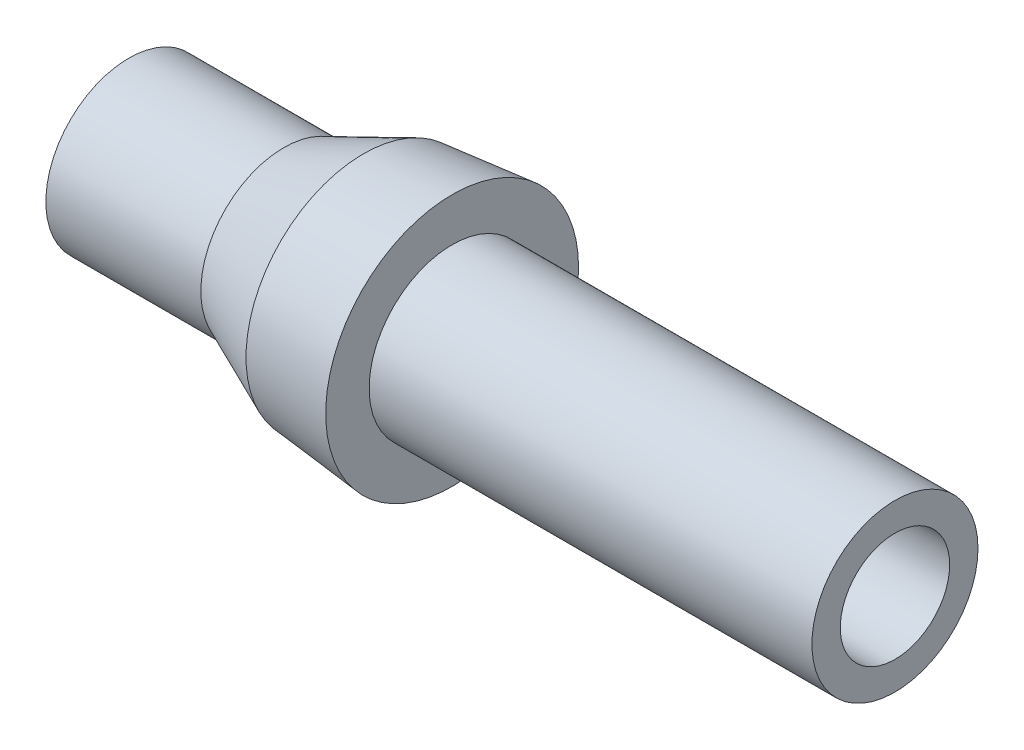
ISO-10303-21;
HEADER;
FILE_DESCRIPTION(('STEP AP214'),'2;1');
FILE_NAME('part.step','',(''),(''),'','','');
FILE_SCHEMA(('AUTOMOTIVE_DESIGN { 1 0 10303 214 1 1 1 1 }'));
ENDSEC;
DATA;
#1=APPLICATION_CONTEXT('core data for automotive mechanical design processes');
#2=APPLICATION_PROTOCOL_DEFINITION('international standard','automotive_design',2000,#1);
#3=PRODUCT_CONTEXT('',#1,'mechanical');
#4=PRODUCT('Part','Part','',(#3));
#5=PRODUCT_RELATED_PRODUCT_CATEGORY('part','',(#4));
#6=PRODUCT_DEFINITION_FORMATION('','',#4);
#7=PRODUCT_DEFINITION_CONTEXT('part definition',#1,'design');
#8=PRODUCT_DEFINITION('design','',#6,#7);
#9=PRODUCT_DEFINITION_SHAPE('','',#8);
#10=(LENGTH_UNIT() NAMED_UNIT(*) SI_UNIT(.MILLI.,.METRE.));
#11=(NAMED_UNIT(*) PLANE_ANGLE_UNIT() SI_UNIT($,.RADIAN.));
#12=(NAMED_UNIT(*) SI_UNIT($,.STERADIAN.) SOLID_ANGLE_UNIT());
#13=UNCERTAINTY_MEASURE_WITH_UNIT(LENGTH_MEASURE(1.E-05),#10,'distance_accuracy_value','');
#14=(GEOMETRIC_REPRESENTATION_CONTEXT(3) GLOBAL_UNCERTAINTY_ASSIGNED_CONTEXT((#13)) GLOBAL_UNIT_ASSIGNED_CONTEXT((#10,
#11,#12)) REPRESENTATION_CONTEXT('',''));
#15=CARTESIAN_POINT('',(0.,0.,0.));
#16=DIRECTION('',(0.,0.,1.));
#17=DIRECTION('',(1.,0.,0.));
#18=AXIS2_PLACEMENT_3D('',#15,#16,#17);
#19=CARTESIAN_POINT('',(21.971,0.,-2.38125));
#20=DIRECTION('',(1.,0.,0.));
#21=DIRECTION('',(0.,0.,-1.));
#22=AXIS2_PLACEMENT_3D('',#19,#20,#21);
#23=PLANE('',#22);
#24=CARTESIAN_POINT('',(21.971,0.,0.));
#25=DIRECTION('',(1.,0.,0.));
#26=DIRECTION('',(0.,0.,-1.));
#27=AXIS2_PLACEMENT_3D('',#24,#25,#26);
#28=CIRCLE('',#27,1.56845);
#29=CARTESIAN_POINT('',(21.971,0.,-1.56845));
#30=VERTEX_POINT('',#29);
#31=EDGE_CURVE('E60',#30,#30,#28,.T.);
#32=ORIENTED_EDGE('',*,*,#31,.F.);
#33=EDGE_LOOP('',(#32));
#34=FACE_BOUND('',#33,.T.);
#35=CARTESIAN_POINT('',(21.971,0.,0.));
#36=DIRECTION('',(1.,0.,0.));
#37=DIRECTION('',(0.,0.,-1.));
#38=AXIS2_PLACEMENT_3D('',#35,#36,#37);
#39=CIRCLE('',#38,2.38125);
#40=CARTESIAN_POINT('',(21.971,0.,-2.38125));
#41=VERTEX_POINT('',#40);
#42=EDGE_CURVE('E10',#41,#41,#39,.T.);
#43=ORIENTED_EDGE('',*,*,#42,.T.);
#44=EDGE_LOOP('',(#43));
#45=FACE_BOUND('',#44,.T.);
#46=ADVANCED_FACE('F32',(#34,#45),#23,.T.);
#47=CARTESIAN_POINT('',(21.971,0.,0.));
#48=DIRECTION('',(1.,0.,0.));
#49=DIRECTION('',(0.,0.,-1.));
#50=AXIS2_PLACEMENT_3D('',#47,#48,#49);
#51=CYLINDRICAL_SURFACE('',#50,2.38125);
#52=CARTESIAN_POINT('',(9.271,0.,0.));
#53=DIRECTION('',(1.,0.,0.));
#54=DIRECTION('',(0.,0.,-1.));
#55=AXIS2_PLACEMENT_3D('',#52,#53,#54);
#56=CIRCLE('',#55,2.38125);
#57=CARTESIAN_POINT('',(9.271,0.,-2.38125));
#58=VERTEX_POINT('',#57);
#59=EDGE_CURVE('E38',#58,#58,#56,.T.);
#60=ORIENTED_EDGE('',*,*,#59,.T.);
#61=EDGE_LOOP('',(#60));
#62=FACE_BOUND('',#61,.T.);
#63=ORIENTED_EDGE('',*,*,#42,.F.);
#64=EDGE_LOOP('',(#63));
#65=FACE_BOUND('',#64,.T.);
#66=ADVANCED_FACE('F67',(#62,#65),#51,.T.);
#67=CARTESIAN_POINT('',(9.271,0.,-2.38125));
#68=DIRECTION('',(1.,0.,0.));
#69=DIRECTION('',(0.,0.,-1.));
#70=AXIS2_PLACEMENT_3D('',#67,#68,#69);
#71=PLANE('',#70);
#72=CARTESIAN_POINT('',(9.271,0.,0.));
#73=DIRECTION('',(1.,0.,0.));
#74=DIRECTION('',(0.,0.,-1.));
#75=AXIS2_PLACEMENT_3D('',#72,#73,#74);
#76=CIRCLE('',#75,3.62585);
#77=CARTESIAN_POINT('',(9.271,0.,-3.62585));
#78=VERTEX_POINT('',#77);
#79=EDGE_CURVE('E42',#78,#78,#76,.T.);
#80=ORIENTED_EDGE('',*,*,#79,.T.);
#81=EDGE_LOOP('',(#80));
#82=FACE_BOUND('',#81,.T.);
#83=ORIENTED_EDGE('',*,*,#59,.F.);
#84=EDGE_LOOP('',(#83));
#85=FACE_BOUND('',#84,.T.);
#86=ADVANCED_FACE('F71',(#82,#85),#71,.T.);
#87=CARTESIAN_POINT('',(9.271,0.,0.));
#88=DIRECTION('',(1.,0.,0.));
#89=DIRECTION('',(0.,0.,-1.));
#90=AXIS2_PLACEMENT_3D('',#87,#88,#89);
#91=CONICAL_SURFACE('',#90,3.62585,0.099668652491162);
#92=CARTESIAN_POINT('',(6.731,0.,0.));
#93=DIRECTION('',(1.,0.,0.));
#94=DIRECTION('',(0.,0.,-1.));
#95=AXIS2_PLACEMENT_3D('',#92,#93,#94);
#96=CIRCLE('',#95,3.37185);
#97=CARTESIAN_POINT('',(6.731,0.,-3.37185));
#98=VERTEX_POINT('',#97);
#99=EDGE_CURVE('E46',#98,#98,#96,.T.);
#100=ORIENTED_EDGE('',*,*,#99,.T.);
#101=EDGE_LOOP('',(#100));
#102=FACE_BOUND('',#101,.T.);
#103=ORIENTED_EDGE('',*,*,#79,.F.);
#104=EDGE_LOOP('',(#103));
#105=FACE_BOUND('',#104,.T.);
#106=ADVANCED_FACE('F75',(#102,#105),#91,.T.);
#107=CARTESIAN_POINT('',(6.731,0.,0.));
#108=DIRECTION('',(1.,0.,0.));
#109=DIRECTION('',(0.,0.,-1.));
#110=AXIS2_PLACEMENT_3D('',#107,#108,#109);
#111=CONICAL_SURFACE('',#110,3.37185,0.408907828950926);
#112=CARTESIAN_POINT('',(4.445,0.,0.));
#113=DIRECTION('',(1.,0.,0.));
#114=DIRECTION('',(0.,0.,-1.));
#115=AXIS2_PLACEMENT_3D('',#112,#113,#114);
#116=CIRCLE('',#115,2.38125);
#117=CARTESIAN_POINT('',(4.445,0.,-2.38125));
#118=VERTEX_POINT('',#117);
#119=EDGE_CURVE('E51',#118,#118,#116,.T.);
#120=ORIENTED_EDGE('',*,*,#119,.T.);
#121=EDGE_LOOP('',(#120));
#122=FACE_BOUND('',#121,.T.);
#123=ORIENTED_EDGE('',*,*,#99,.F.);
#124=EDGE_LOOP('',(#123));
#125=FACE_BOUND('',#124,.T.);
#126=ADVANCED_FACE('F82',(#122,#125),#111,.T.);
#127=CARTESIAN_POINT('',(21.971,0.,0.));
#128=DIRECTION('',(1.,0.,0.));
#129=DIRECTION('',(0.,0.,-1.));
#130=AXIS2_PLACEMENT_3D('',#127,#128,#129);
#131=CYLINDRICAL_SURFACE('',#130,2.38125);
#132=CARTESIAN_POINT('',(0.,0.,0.));
#133=DIRECTION('',(1.,0.,0.));
#134=DIRECTION('',(0.,0.,-1.));
#135=AXIS2_PLACEMENT_3D('',#132,#133,#134);
#136=CIRCLE('',#135,2.38125);
#137=CARTESIAN_POINT('',(0.,0.,-2.38125));
#138=VERTEX_POINT('',#137);
#139=EDGE_CURVE('E54',#138,#138,#136,.T.);
#140=ORIENTED_EDGE('',*,*,#139,.T.);
#141=EDGE_LOOP('',(#140));
#142=FACE_BOUND('',#141,.T.);
#143=ORIENTED_EDGE('',*,*,#119,.F.);
#144=EDGE_LOOP('',(#143));
#145=FACE_BOUND('',#144,.T.);
#146=ADVANCED_FACE('F86',(#142,#145),#131,.T.);
#147=CARTESIAN_POINT('',(0.,0.,0.));
#148=DIRECTION('',(-1.,0.,0.));
#149=DIRECTION('',(0.,0.,1.));
#150=AXIS2_PLACEMENT_3D('',#147,#148,#149);
#151=PLANE('',#150);
#152=CARTESIAN_POINT('',(0.,0.,0.));
#153=DIRECTION('',(1.,0.,0.));
#154=DIRECTION('',(0.,0.,-1.));
#155=AXIS2_PLACEMENT_3D('',#152,#153,#154);
#156=CIRCLE('',#155,1.56845);
#157=CARTESIAN_POINT('',(0.,0.,-1.56845));
#158=VERTEX_POINT('',#157);
#159=EDGE_CURVE('E57',#158,#158,#156,.T.);
#160=ORIENTED_EDGE('',*,*,#159,.T.);
#161=EDGE_LOOP('',(#160));
#162=FACE_BOUND('',#161,.T.);
#163=ORIENTED_EDGE('',*,*,#139,.F.);
#164=EDGE_LOOP('',(#163));
#165=FACE_BOUND('',#164,.T.);
#166=ADVANCED_FACE('F90',(#162,#165),#151,.T.);
#167=CARTESIAN_POINT('',(0.,0.,0.));
#168=DIRECTION('',(1.,0.,0.));
#169=DIRECTION('',(0.,0.,-1.));
#170=AXIS2_PLACEMENT_3D('',#167,#168,#169);
#171=CYLINDRICAL_SURFACE('',#170,1.56845);
#172=CARTESIAN_POINT('',(0.,0.,-1.56845));
#173=CARTESIAN_POINT('',(0.228864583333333,0.,-1.56845));
#174=CARTESIAN_POINT('',(0.457729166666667,0.,-1.56845));
#175=CARTESIAN_POINT('',(0.915458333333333,0.,-1.56845));
#176=CARTESIAN_POINT('',(1.14432291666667,0.,-1.56845));
#177=CARTESIAN_POINT('',(1.60205208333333,0.,-1.56845));
#178=CARTESIAN_POINT('',(1.83091666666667,0.,-1.56845));
#179=CARTESIAN_POINT('',(2.28864583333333,0.,-1.56845));
#180=CARTESIAN_POINT('',(2.51751041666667,0.,-1.56845));
#181=CARTESIAN_POINT('',(2.97523958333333,0.,-1.56845));
#182=CARTESIAN_POINT('',(3.20410416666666,0.,-1.56845));
#183=CARTESIAN_POINT('',(3.66183333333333,0.,-1.56845));
#184=CARTESIAN_POINT('',(3.89069791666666,0.,-1.56845));
#185=CARTESIAN_POINT('',(4.34842708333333,0.,-1.56845));
#186=CARTESIAN_POINT('',(4.57729166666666,0.,-1.56845));
#187=CARTESIAN_POINT('',(5.03502083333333,0.,-1.56845));
#188=CARTESIAN_POINT('',(5.26388541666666,0.,-1.56845));
#189=CARTESIAN_POINT('',(5.72161458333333,0.,-1.56845));
#190=CARTESIAN_POINT('',(5.95047916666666,0.,-1.56845));
#191=CARTESIAN_POINT('',(6.40820833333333,0.,-1.56845));
#192=CARTESIAN_POINT('',(6.63707291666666,0.,-1.56845));
#193=CARTESIAN_POINT('',(7.09480208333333,0.,-1.56845));
#194=CARTESIAN_POINT('',(7.32366666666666,0.,-1.56845));
#195=CARTESIAN_POINT('',(7.78139583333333,0.,-1.56845));
#196=CARTESIAN_POINT('',(8.01026041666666,0.,-1.56845));
#197=CARTESIAN_POINT('',(8.46798958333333,0.,-1.56845));
#198=CARTESIAN_POINT('',(8.69685416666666,0.,-1.56845));
#199=CARTESIAN_POINT('',(9.15458333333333,0.,-1.56845));
#200=CARTESIAN_POINT('',(9.38344791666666,0.,-1.56845));
#201=CARTESIAN_POINT('',(9.84117708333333,0.,-1.56845));
#202=CARTESIAN_POINT('',(10.0700416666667,0.,-1.56845));
#203=CARTESIAN_POINT('',(10.5277708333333,0.,-1.56845));
#204=CARTESIAN_POINT('',(10.7566354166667,0.,-1.56845));
#205=CARTESIAN_POINT('',(11.2143645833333,0.,-1.56845));
#206=CARTESIAN_POINT('',(11.4432291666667,0.,-1.56845));
#207=CARTESIAN_POINT('',(11.9009583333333,0.,-1.56845));
#208=CARTESIAN_POINT('',(12.1298229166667,0.,-1.56845));
#209=CARTESIAN_POINT('',(12.5875520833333,0.,-1.56845));
#210=CARTESIAN_POINT('',(12.8164166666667,0.,-1.56845));
#211=CARTESIAN_POINT('',(13.2741458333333,0.,-1.56845));
#212=CARTESIAN_POINT('',(13.5030104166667,0.,-1.56845));
#213=CARTESIAN_POINT('',(13.9607395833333,0.,-1.56845));
#214=CARTESIAN_POINT('',(14.1896041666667,0.,-1.56845));
#215=CARTESIAN_POINT('',(14.6473333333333,0.,-1.56845));
#216=CARTESIAN_POINT('',(14.8761979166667,0.,-1.56845));
#217=CARTESIAN_POINT('',(15.3339270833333,0.,-1.56845));
#218=CARTESIAN_POINT('',(15.5627916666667,0.,-1.56845));
#219=CARTESIAN_POINT('',(16.0205208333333,0.,-1.56845));
#220=CARTESIAN_POINT('',(16.2493854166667,0.,-1.56845));
#221=CARTESIAN_POINT('',(16.7071145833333,0.,-1.56845));
#222=CARTESIAN_POINT('',(16.9359791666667,0.,-1.56845));
#223=CARTESIAN_POINT('',(17.3937083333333,0.,-1.56845));
#224=CARTESIAN_POINT('',(17.6225729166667,0.,-1.56845));
#225=CARTESIAN_POINT('',(18.0803020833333,0.,-1.56845));
#226=CARTESIAN_POINT('',(18.3091666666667,0.,-1.56845));
#227=CARTESIAN_POINT('',(18.7668958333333,0.,-1.56845));
#228=CARTESIAN_POINT('',(18.9957604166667,0.,-1.56845));
#229=CARTESIAN_POINT('',(19.4534895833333,0.,-1.56845));
#230=CARTESIAN_POINT('',(19.6823541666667,0.,-1.56845));
#231=CARTESIAN_POINT('',(20.1400833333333,0.,-1.56845));
#232=CARTESIAN_POINT('',(20.3689479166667,0.,-1.56845));
#233=CARTESIAN_POINT('',(20.8266770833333,0.,-1.56845));
#234=CARTESIAN_POINT('',(21.0555416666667,0.,-1.56845));
#235=CARTESIAN_POINT('',(21.5132708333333,0.,-1.56845));
#236=CARTESIAN_POINT('',(21.7421354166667,0.,-1.56845));
#237=CARTESIAN_POINT('',(21.971,0.,-1.56845));
#238=B_SPLINE_CURVE_WITH_KNOTS('',3,(#172,#173,#174,#175,#176,#177,#178,#179,#180,#181,#182,
#183,#184,#185,#186,#187,#188,#189,#190,#191,#192,#193,#194,#195,#196,#197,#198,#199,#200,#201,
#202,#203,#204,#205,#206,#207,#208,#209,#210,#211,#212,#213,#214,#215,#216,#217,#218,#219,#220,
#221,#222,#223,#224,#225,#226,#227,#228,#229,#230,#231,#232,#233,#234,#235,#236,#237),
.UNSPECIFIED.,.F.,.F.,(4,2,2,2,2,2,2,2,2,2,2,2,2,2,2,2,2,2,2,2,2,2,2,2,2,2,2,2,2,2,2,2,4),(0.,
0.68659375,1.3731875,2.05978125,2.746375,3.43296875,4.1195625,4.80615625,5.49275,6.17934375,
6.8659375,7.55253125,8.23912499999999,8.92571874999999,9.61231249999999,10.29890625,10.9855,
11.67209375,12.3586875,13.04528125,13.731875,14.41846875,15.1050625,15.79165625,16.47825,
17.16484375,17.8514375,18.53803125,19.224625,19.91121875,20.5978125,21.28440625,21.971),.UNSPECIFIED.);
#239=EDGE_CURVE('BSEAM64',#158,#30,#238,.T.);
#240=ORIENTED_EDGE('',*,*,#159,.F.);
#241=ORIENTED_EDGE('',*,*,#31,.T.);
#242=ORIENTED_EDGE('',*,*,#239,.T.);
#243=ORIENTED_EDGE('',*,*,#239,.F.);
#244=EDGE_LOOP('',(#240,#242,#241,#243));
#245=FACE_BOUND('',#244,.T.);
#246=ADVANCED_FACE('F64',(#245),#171,.F.);
#247=CLOSED_SHELL('',(#46,#66,#86,#106,#126,#146,#166,#246));
#248=MANIFOLD_SOLID_BREP('B2',#247);
#249=ADVANCED_BREP_SHAPE_REPRESENTATION('',(#18,#248),#14);
#250=SHAPE_DEFINITION_REPRESENTATION(#9,#249);
ENDSEC;
END-ISO-10303-21;
